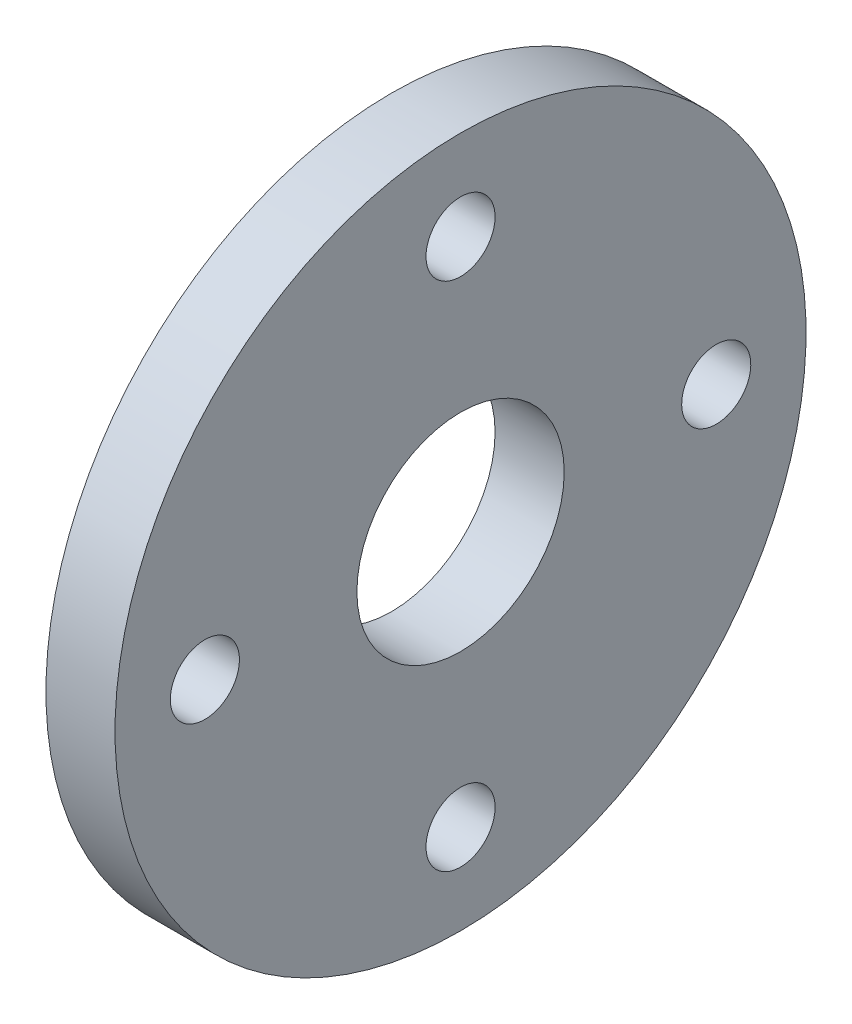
from build123d import *

# Parameters (mm, degrees)
SKETCH1_R           = 50
SKETCH1_R_2         = 5
SKETCH1_R_3         = 15
BOSS_EXTRUDE1_DEPTH = 10


with BuildPart() as part:
    # Sketch1 → Boss-Extrude1 (new body)
    with BuildSketch(Plane(origin=(182.5, 0, 0), x_dir=(0, 0, -1), z_dir=(1, 0, 0))):
        with Locations(Location((0, 139, 0), (0, 0, 90))):
            Circle(SKETCH1_R)
        with Locations(Location((-37, 139, 0), (0, 0, 90))):
            Circle(SKETCH1_R_2, mode=Mode.SUBTRACT)
        with Locations(Location((0, 176, 0), (0, 0, 90))):
            Circle(SKETCH1_R_2, mode=Mode.SUBTRACT)
        with Locations(Location((37, 139, 0), (0, 0, 90))):
            Circle(SKETCH1_R_2, mode=Mode.SUBTRACT)
        with Locations(Location((0, 102, 0), (0, 0, 90))):
            Circle(SKETCH1_R_2, mode=Mode.SUBTRACT)
        with Locations(Location((0, 139, 0), (0, 0, 90))):
            Circle(SKETCH1_R_3, mode=Mode.SUBTRACT)
    extrude(amount=BOSS_EXTRUDE1_DEPTH)


solid = part.part
